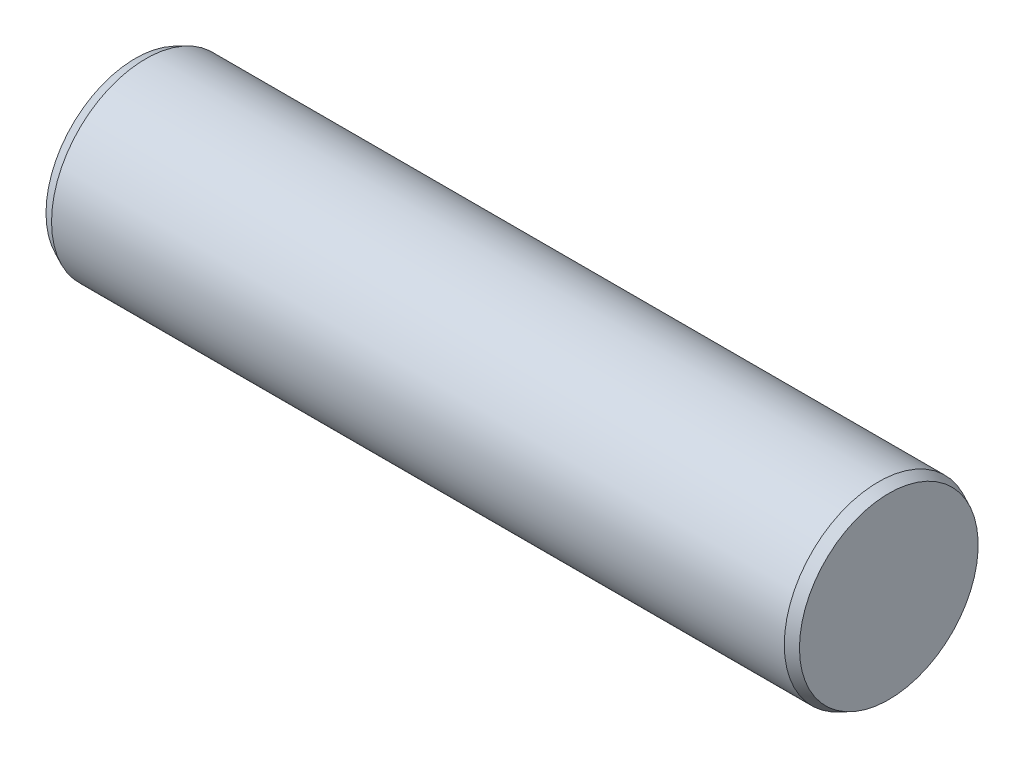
ISO-10303-21;
HEADER;
FILE_DESCRIPTION(('STEP AP214'),'2;1');
FILE_NAME('part.step','',(''),(''),'','','');
FILE_SCHEMA(('AUTOMOTIVE_DESIGN { 1 0 10303 214 1 1 1 1 }'));
ENDSEC;
DATA;
#1=APPLICATION_CONTEXT('core data for automotive mechanical design processes');
#2=APPLICATION_PROTOCOL_DEFINITION('international standard','automotive_design',2000,#1);
#3=PRODUCT_CONTEXT('',#1,'mechanical');
#4=PRODUCT('Part','Part','',(#3));
#5=PRODUCT_RELATED_PRODUCT_CATEGORY('part','',(#4));
#6=PRODUCT_DEFINITION_FORMATION('','',#4);
#7=PRODUCT_DEFINITION_CONTEXT('part definition',#1,'design');
#8=PRODUCT_DEFINITION('design','',#6,#7);
#9=PRODUCT_DEFINITION_SHAPE('','',#8);
#10=(LENGTH_UNIT() NAMED_UNIT(*) SI_UNIT(.MILLI.,.METRE.));
#11=(NAMED_UNIT(*) PLANE_ANGLE_UNIT() SI_UNIT($,.RADIAN.));
#12=(NAMED_UNIT(*) SI_UNIT($,.STERADIAN.) SOLID_ANGLE_UNIT());
#13=UNCERTAINTY_MEASURE_WITH_UNIT(LENGTH_MEASURE(1.E-05),#10,'distance_accuracy_value','');
#14=(GEOMETRIC_REPRESENTATION_CONTEXT(3) GLOBAL_UNCERTAINTY_ASSIGNED_CONTEXT((#13)) GLOBAL_UNIT_ASSIGNED_CONTEXT((#10,
#11,#12)) REPRESENTATION_CONTEXT('',''));
#15=CARTESIAN_POINT('',(0.,0.,0.));
#16=DIRECTION('',(0.,0.,1.));
#17=DIRECTION('',(1.,0.,0.));
#18=AXIS2_PLACEMENT_3D('',#15,#16,#17);
#19=CARTESIAN_POINT('',(0.,12.0485682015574,0.));
#20=DIRECTION('',(1.,0.,0.));
#21=DIRECTION('',(0.,0.,-1.));
#22=AXIS2_PLACEMENT_3D('',#19,#20,#21);
#23=PLANE('',#22);
#24=CARTESIAN_POINT('',(0.,0.,0.));
#25=DIRECTION('',(-1.,0.,0.));
#26=DIRECTION('',(0.,0.,1.));
#27=AXIS2_PLACEMENT_3D('',#24,#25,#26);
#28=CIRCLE('',#27,12.0485682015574);
#29=CARTESIAN_POINT('',(0.,0.,12.0485682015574));
#30=VERTEX_POINT('',#29);
#31=EDGE_CURVE('E51',#30,#30,#28,.T.);
#32=ORIENTED_EDGE('',*,*,#31,.T.);
#33=EDGE_LOOP('',(#32));
#34=FACE_BOUND('',#33,.T.);
#35=ADVANCED_FACE('F37',(#34),#23,.F.);
#36=CARTESIAN_POINT('',(101.6,0.,0.));
#37=DIRECTION('',(-1.,0.,0.));
#38=DIRECTION('',(0.,0.,1.));
#39=AXIS2_PLACEMENT_3D('',#36,#37,#38);
#40=PLANE('',#39);
#41=CARTESIAN_POINT('',(101.6,0.,0.));
#42=DIRECTION('',(-1.,0.,0.));
#43=DIRECTION('',(0.,0.,1.));
#44=AXIS2_PLACEMENT_3D('',#41,#42,#43);
#45=CIRCLE('',#44,12.0485682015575);
#46=CARTESIAN_POINT('',(101.6,0.,12.0485682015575));
#47=VERTEX_POINT('',#46);
#48=EDGE_CURVE('E10',#47,#47,#45,.T.);
#49=ORIENTED_EDGE('',*,*,#48,.F.);
#50=EDGE_LOOP('',(#49));
#51=FACE_BOUND('',#50,.T.);
#52=ADVANCED_FACE('F71',(#51),#40,.F.);
#53=CARTESIAN_POINT('',(101.6,0.,0.));
#54=DIRECTION('',(-1.,0.,0.));
#55=DIRECTION('',(0.,0.,1.));
#56=AXIS2_PLACEMENT_3D('',#53,#54,#55);
#57=CONICAL_SURFACE('',#56,12.0485682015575,0.436332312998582);
#58=CARTESIAN_POINT('',(100.203,0.,0.));
#59=DIRECTION('',(-1.,0.,0.));
#60=DIRECTION('',(0.,0.,1.));
#61=AXIS2_PLACEMENT_3D('',#58,#59,#60);
#62=CIRCLE('',#61,12.7);
#63=CARTESIAN_POINT('',(100.203,0.,12.7));
#64=VERTEX_POINT('',#63);
#65=EDGE_CURVE('E43',#64,#64,#62,.T.);
#66=ORIENTED_EDGE('',*,*,#65,.F.);
#67=EDGE_LOOP('',(#66));
#68=FACE_BOUND('',#67,.T.);
#69=ORIENTED_EDGE('',*,*,#48,.T.);
#70=EDGE_LOOP('',(#69));
#71=FACE_BOUND('',#70,.T.);
#72=ADVANCED_FACE('F66',(#68,#71),#57,.T.);
#73=CARTESIAN_POINT('',(-6.35,0.,0.));
#74=DIRECTION('',(-1.,0.,0.));
#75=DIRECTION('',(0.,0.,1.));
#76=AXIS2_PLACEMENT_3D('',#73,#74,#75);
#77=CYLINDRICAL_SURFACE('',#76,12.7);
#78=CARTESIAN_POINT('',(1.397,0.,0.));
#79=DIRECTION('',(-1.,0.,0.));
#80=DIRECTION('',(0.,0.,1.));
#81=AXIS2_PLACEMENT_3D('',#78,#79,#80);
#82=CIRCLE('',#81,12.7);
#83=CARTESIAN_POINT('',(1.397,0.,12.7));
#84=VERTEX_POINT('',#83);
#85=EDGE_CURVE('E47',#84,#84,#82,.T.);
#86=ORIENTED_EDGE('',*,*,#85,.F.);
#87=EDGE_LOOP('',(#86));
#88=FACE_BOUND('',#87,.T.);
#89=ORIENTED_EDGE('',*,*,#65,.T.);
#90=EDGE_LOOP('',(#89));
#91=FACE_BOUND('',#90,.T.);
#92=ADVANCED_FACE('F61',(#88,#91),#77,.T.);
#93=CARTESIAN_POINT('',(1.397,0.,0.));
#94=DIRECTION('',(1.,0.,0.));
#95=DIRECTION('',(0.,0.,-1.));
#96=AXIS2_PLACEMENT_3D('',#93,#94,#95);
#97=CONICAL_SURFACE('',#96,12.7,0.436332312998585);
#98=ORIENTED_EDGE('',*,*,#31,.F.);
#99=EDGE_LOOP('',(#98));
#100=FACE_BOUND('',#99,.T.);
#101=ORIENTED_EDGE('',*,*,#85,.T.);
#102=EDGE_LOOP('',(#101));
#103=FACE_BOUND('',#102,.T.);
#104=ADVANCED_FACE('F58',(#100,#103),#97,.T.);
#105=CLOSED_SHELL('',(#35,#52,#72,#92,#104));
#106=MANIFOLD_SOLID_BREP('B2',#105);
#107=ADVANCED_BREP_SHAPE_REPRESENTATION('',(#18,#106),#14);
#108=SHAPE_DEFINITION_REPRESENTATION(#9,#107);
ENDSEC;
END-ISO-10303-21;
